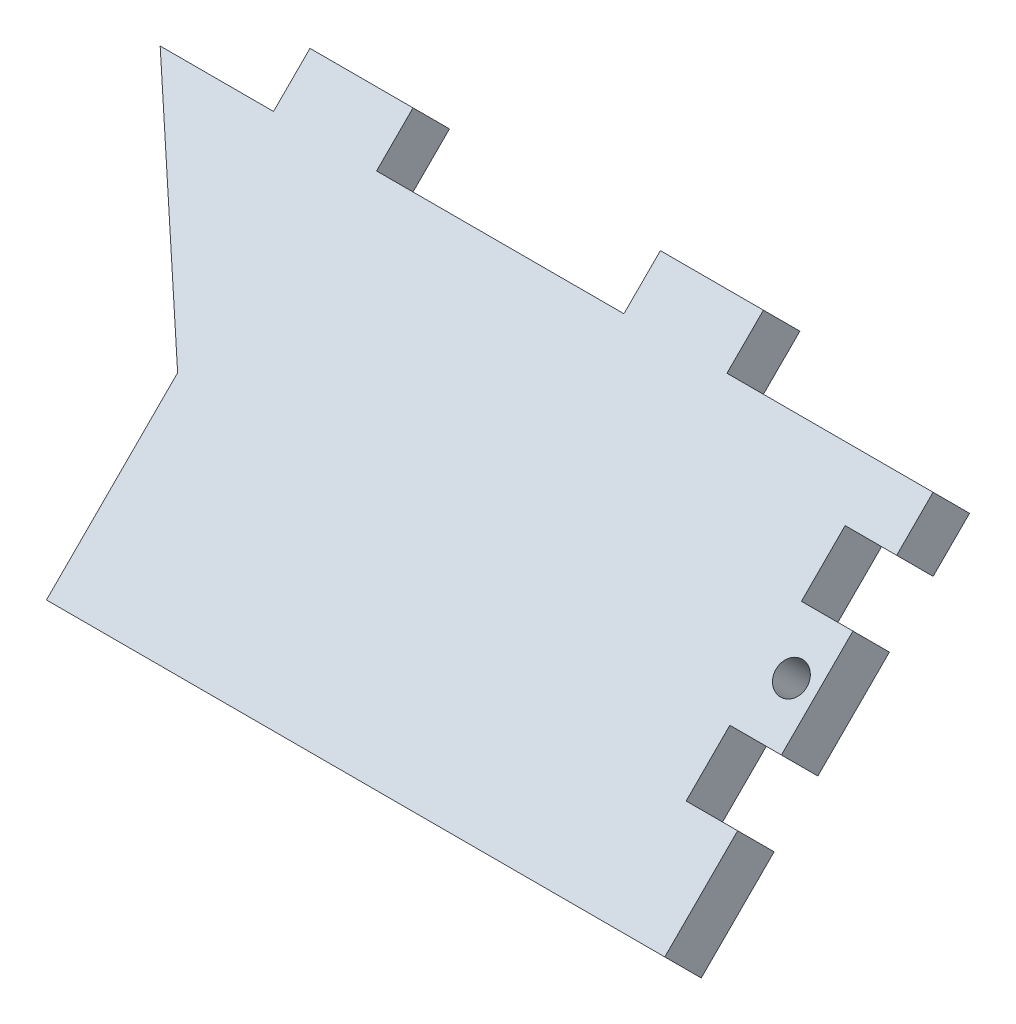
from build123d import *

# Parameters (mm, degrees)
BOSS_EXTRUDE7_DEPTH = 6.35
SKETCH7_R           = 1.905
CUT_EXTRUDE1_DEPTH  = 6.35


with BuildPart() as part:
    # Sketch3 → Boss-Extrude7 (new body)
    with BuildSketch(Plane(origin=(0, 0, 0), x_dir=(1, 0, 0), z_dir=(0, 0.7071067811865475, 0.7071067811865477))):
        Polygon((-76.2, 0), (0, 0), (0, 12.7), (-6.35, 12.7), (-6.35, 20.32), (0, 20.32), (0, 32.7914), (-6.35, 32.7914), (-6.35, 40.4114), (0, 40.4114), (0, 46.75886), (-25.4, 46.75886), (-25.4, 53.10886), (-38.1, 53.10886), (-38.1, 46.75886), (-68.58, 46.75886), (-68.58, 53.10886), (-81.28, 53.10886), (-81.28, 46.75886), (-95.25, 46.75886), (-76.2, 22.86), align=None)
    extrude(amount=BOSS_EXTRUDE7_DEPTH)

    # Sketch7 → Cut-Extrude1 (cut)
    with BuildSketch(Plane(origin=(0, 4.490128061, 4.490128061), x_dir=(1, 0, 0), z_dir=(0, 0.7071067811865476, 0.7071067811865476))):
        with Locations(Location((-3.175, 26.5557, 0), (0, 0, 270))):
            Circle(SKETCH7_R)
    extrude(amount=-CUT_EXTRUDE1_DEPTH, mode=Mode.SUBTRACT)


solid = part.part
